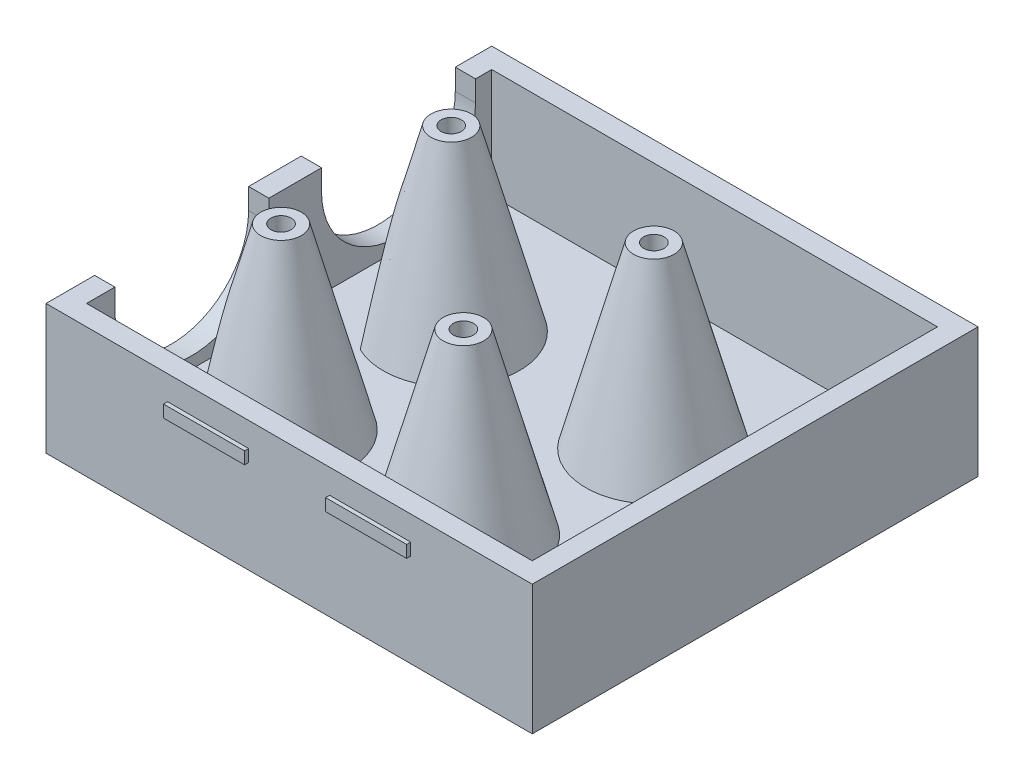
from build123d import *

# Parameters (mm, degrees)
SKETCH1_W           = 60
SKETCH1_H           = 55
BOSS_EXTRUDE1_DEPTH = 2.5
SKETCH3_W           = 60
SKETCH3_H           = 55
SKETCH3_W_2         = 55
SKETCH3_H_2         = 50
BOSS_EXTRUDE2_DEPTH = 13.5
SKETCH4_R           = 2.5
BOSS_EXTRUDE3_DEPTH = 22
SKETCH7_R           = 1.25
CUT_EXTRUDE1_DEPTH  = 10
SKETCH8_R           = 1.25
CUT_EXTRUDE2_DEPTH  = 10
SKETCH11_R          = 1.25
CUT_EXTRUDE3_DEPTH  = 10
SKETCH12_R          = 1.25
CUT_EXTRUDE4_DEPTH  = 10
CUT_EXTRUDE5_DEPTH  = 2.5
SKETCH14_W          = 10
SKETCH14_H          = 1.5
BOSS_EXTRUDE4_DEPTH = 0.5
SKETCH15_W          = 10
SKETCH15_H          = 1.5
BOSS_EXTRUDE5_DEPTH = 0.5
SKETCH16_W          = 6.3182538
SKETCH16_H          = 42.004687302
CUT_EXTRUDE6_DEPTH  = 22


with BuildPart() as part:
    # Sketch1 → Boss-Extrude1 (new body)
    with BuildSketch(Plane(origin=(0, 0, 0), x_dir=(1, 0, 0), z_dir=(0, 1, 0))):
        with Locations((3.642172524, 13.706070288)):
            Rectangle(SKETCH1_W, SKETCH1_H)
    extrude(amount=BOSS_EXTRUDE1_DEPTH)

    # Sketch3 → Boss-Extrude2 (add)
    with BuildSketch(Plane(origin=(0, 2.5, 0), x_dir=(1, 0, 0), z_dir=(0, 1, 0))):
        with Locations((3.642172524, 13.706070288)):
            Rectangle(SKETCH3_W, SKETCH3_H)
        with Locations((3.642172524, 13.706070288)):
            Rectangle(SKETCH3_W_2, SKETCH3_H_2, mode=Mode.SUBTRACT)
    extrude(amount=BOSS_EXTRUDE2_DEPTH)

    # Sketch4 → Boss-Extrude3 (add)
    with BuildSketch(Plane(origin=(0, 2.5, 0), x_dir=(1, 0, 0), z_dir=(0, 1, 0))):
        with Locations(Location((-11.857827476, 0.706070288, 0), (0, 0, 270))):
            Circle(SKETCH4_R)
        with Locations(Location((10.642172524, 0.706070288, 0), (0, 0, 270))):
            Circle(SKETCH4_R)
        with Locations(Location((-11.857827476, 21.706070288, 0), (0, 0, 270))):
            Circle(SKETCH4_R)
        with Locations(Location((13.142172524, 21.706070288, 0), (0, 0, 270))):
            Circle(SKETCH4_R)
    extrude(amount=BOSS_EXTRUDE3_DEPTH)

    # Sketch5 → Revolve1 (revolve)
    with BuildSketch(Plane(origin=(0, 0, -0.706070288), x_dir=(0, -1, 0), z_dir=(0, 0, 1)), mode=Mode.PRIVATE) as revolve1_sk:
        Polygon((-24.5, -9.357827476), (-2.5, -9.357827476), (-2.5, -3.462945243), align=None)
    revolve(revolve1_sk.sketch.rotate(Axis((-11.857827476, 24.5, -0.706070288), (0, -1, 0)), 270), axis=Axis((-11.857827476, 24.5, -0.706070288), (0, -1, 0)))

    # Sketch6 → Revolve2 (revolve)
    with BuildSketch(Plane(origin=(0, 0, -0.706070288), x_dir=(0, -1, 0), z_dir=(0, 0, 1)), mode=Mode.PRIVATE) as revolve2_sk:
        Polygon((-24.5, 13.142172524), (-2.5, 13.142172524), (-2.5, 19.037054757), align=None)
    revolve(revolve2_sk.sketch.rotate(Axis((10.642172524, 24.5, -0.706070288), (0, -1, 0)), 270), axis=Axis((10.642172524, 24.5, -0.706070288), (0, -1, 0)))

    # Sketch7 → Cut-Extrude1 (cut)
    with BuildSketch(Plane(origin=(0, 24.5, 0), x_dir=(1, 0, 0), z_dir=(0, 1, 0))):
        with Locations(Location((10.642172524, 0.706070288, 0), (0, 0, 270))):
            Circle(SKETCH7_R)
    extrude(amount=-CUT_EXTRUDE1_DEPTH, mode=Mode.SUBTRACT)

    # Sketch8 → Cut-Extrude2 (cut)
    with BuildSketch(Plane(origin=(0, 24.5, 0), x_dir=(1, 0, 0), z_dir=(0, 1, 0))):
        with Locations(Location((-11.857827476, 0.706070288, 0), (0, 0, 270))):
            Circle(SKETCH8_R)
    extrude(amount=-CUT_EXTRUDE2_DEPTH, mode=Mode.SUBTRACT)

    # Sketch9 → Revolve3 (revolve)
    with BuildSketch(Plane.XY.offset(-21.706070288), mode=Mode.PRIVATE) as revolve3_sk:
        Polygon((-9.357827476, 24.5), (-3.462945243, 2.5), (-9.357827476, 2.5), align=None)
    revolve(revolve3_sk.sketch.rotate(Axis((-11.857827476, 24.5, -21.706070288), (0, -1, 0)), 270), axis=Axis((-11.857827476, 24.5, -21.706070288), (0, -1, 0)))

    # Sketch10 → Revolve4 (revolve)
    with BuildSketch(Plane.XY.offset(-21.706070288), mode=Mode.PRIVATE) as revolve4_sk:
        Polygon((15.642172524, 24.5), (15.642172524, 2.5), (21.537054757, 2.5), align=None)
    revolve(revolve4_sk.sketch.rotate(Axis((13.142172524, 24.5, -21.706070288), (0, -1, 0)), 270), axis=Axis((13.142172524, 24.5, -21.706070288), (0, -1, 0)))

    # Sketch11 → Cut-Extrude3 (cut)
    with BuildSketch(Plane(origin=(0, 24.5, 0), x_dir=(1, 0, 0), z_dir=(0, 1, 0))):
        with Locations(Location((-11.857827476, 21.706070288, 0), (0, 0, 270))):
            Circle(SKETCH11_R)
    extrude(amount=-CUT_EXTRUDE3_DEPTH, mode=Mode.SUBTRACT)

    # Sketch12 → Cut-Extrude4 (cut)
    with BuildSketch(Plane(origin=(0, 24.5, 0), x_dir=(1, 0, 0), z_dir=(0, 1, 0))):
        with Locations(Location((13.142172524, 21.706070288, 0), (0, 0, 270))):
            Circle(SKETCH12_R)
    extrude(amount=-CUT_EXTRUDE4_DEPTH, mode=Mode.SUBTRACT)

    # Sketch13 → Cut-Extrude5 (cut)
    with BuildSketch(Plane.ZY.offset(26.357827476)):
        with BuildLine():
            Line((-17.706070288, 16), (-17.706070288, 13.417173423))
            ThreePointArc((-17.706070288, 13.417173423), (-27.206070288, 3.917173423), (-36.706070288, 13.417173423))
            Line((-36.706070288, 13.417173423), (-36.706070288, 16))
            Line((-36.706070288, 16), (-17.706070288, 16))
        make_face()
        with BuildLine():
            Line((-11.206070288, 16), (-11.206070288, 13.417173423))
            ThreePointArc((-11.206070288, 13.417173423), (-1.706070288, 3.917173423), (7.793929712, 13.417173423))
            Line((7.793929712, 13.417173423), (7.793929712, 16))
            Line((7.793929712, 16), (-11.206070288, 16))
        make_face()
    extrude(amount=-CUT_EXTRUDE5_DEPTH, mode=Mode.SUBTRACT)

    # Sketch14 → Boss-Extrude4 (add)
    with BuildSketch(Plane.XY.offset(13.793929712)):
        with Locations((-6.357827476, 12.25)):
            Rectangle(SKETCH14_W, SKETCH14_H)
        with Locations((13.642172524, 12.25)):
            Rectangle(SKETCH14_W, SKETCH14_H)
    extrude(amount=BOSS_EXTRUDE4_DEPTH)

    # Sketch15 → Boss-Extrude5 (add)
    with BuildSketch(Plane(origin=(0, 0, -41.206070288), x_dir=(-1, 0, 0), z_dir=(0, 0, -1))):
        with Locations((6.357827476, 12.25)):
            Rectangle(SKETCH15_W, SKETCH15_H)
        with Locations((-13.642172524, 12.25)):
            Rectangle(SKETCH15_W, SKETCH15_H)
    extrude(amount=BOSS_EXTRUDE5_DEPTH)

    # Sketch16 → Cut-Extrude6 (cut)
    with BuildSketch(Plane(origin=(0, 24.5, 0), x_dir=(1, 0, 0), z_dir=(0, 1, 0))):
        with Locations((-18.695247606, 12.584824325)):
            Rectangle(SKETCH16_W, SKETCH16_H)
    extrude(amount=-CUT_EXTRUDE6_DEPTH, mode=Mode.SUBTRACT)


solid = part.part
